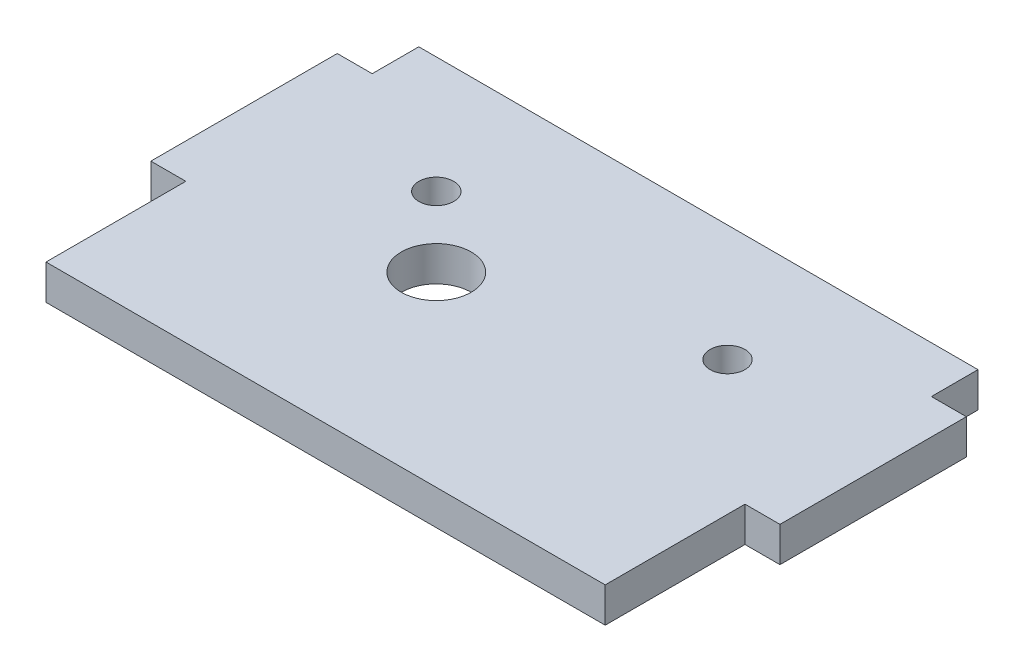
from build123d import *

# Parameters (mm, degrees)
SKETCH1_W           = 48
SKETCH1_H           = 20
BOSS_EXTRUDE1_DEPTH = 3
SKETCH2_W           = 3
SKETCH2_H           = 12
BOSS_EXTRUDE2_DEPTH = 3
SKETCH3_R           = 3
CUT_EXTRUDE1_DEPTH  = 3
SKETCH4_R           = 1.5
CUT_EXTRUDE2_DEPTH  = 3
SKETCH5_W           = 48
SKETCH5_H           = 12
BOSS_EXTRUDE3_DEPTH = 3
SKETCH6_W           = 3
SKETCH6_H           = 4
BOSS_EXTRUDE4_DEPTH = 3


with BuildPart() as part:
    # Sketch1 → Boss-Extrude1 (new body)
    with BuildSketch(Plane(origin=(0, 0, 0), x_dir=(1, 0, 0), z_dir=(0, 1, 0))):
        Rectangle(SKETCH1_W, SKETCH1_H)
    extrude(amount=BOSS_EXTRUDE1_DEPTH)

    # Sketch2 → Boss-Extrude2 (add)
    with BuildSketch(Plane(origin=(0, 0, 0), x_dir=(1, 0, 0), z_dir=(0, 1, 0))):
        with Locations((-25.5, 0)):
            Rectangle(SKETCH2_W, SKETCH2_H)
        with Locations((25.5, 0)):
            Rectangle(SKETCH2_W, SKETCH2_H)
    extrude(amount=BOSS_EXTRUDE2_DEPTH)

    # Sketch3 → Cut-Extrude1 (cut)
    with BuildSketch(Plane(origin=(0, 0, 0), x_dir=(1, 0, 0), z_dir=(0, 1, 0))):
        with Locations(Location((-6.5, -6, 0), (0, 0, 270))):
            Circle(SKETCH3_R)
    extrude(amount=CUT_EXTRUDE1_DEPTH, mode=Mode.SUBTRACT)

    # Sketch4 → Cut-Extrude2 (cut)
    with BuildSketch(Plane(origin=(0, 0, 0), x_dir=(1, 0, 0), z_dir=(0, 1, 0))):
        with Locations(Location((-12.5, 0, 0), (0, 0, 270))):
            Circle(SKETCH4_R)
        with Locations(Location((12.5, 0, 0), (0, 0, 270))):
            Circle(SKETCH4_R)
    extrude(amount=CUT_EXTRUDE2_DEPTH, mode=Mode.SUBTRACT)

    # Sketch5 → Boss-Extrude3 (add)
    with BuildSketch(Plane(origin=(0, 0, 0), x_dir=(1, 0, 0), z_dir=(0, 1, 0))):
        with Locations((0, -16)):
            Rectangle(SKETCH5_W, SKETCH5_H)
    extrude(amount=BOSS_EXTRUDE3_DEPTH)

    # Sketch6 → Boss-Extrude4 (add)
    with BuildSketch(Plane(origin=(0, 0, 0), x_dir=(1, 0, 0), z_dir=(0, 1, 0))):
        with Locations((-25.5, -8)):
            Rectangle(SKETCH6_W, SKETCH6_H)
        with Locations((25.5, -8)):
            Rectangle(SKETCH6_W, SKETCH6_H)
    extrude(amount=BOSS_EXTRUDE4_DEPTH)


solid = part.part
